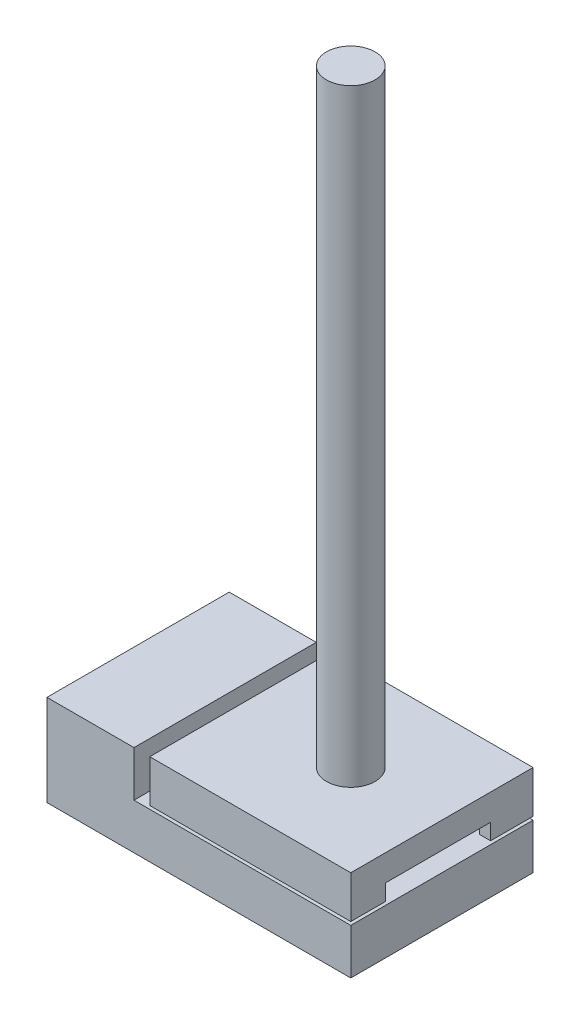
ISO-10303-21;
HEADER;
FILE_DESCRIPTION(('STEP AP214'),'2;1');
FILE_NAME('part.step','',(''),(''),'','','');
FILE_SCHEMA(('AUTOMOTIVE_DESIGN { 1 0 10303 214 1 1 1 1 }'));
ENDSEC;
DATA;
#1=APPLICATION_CONTEXT('core data for automotive mechanical design processes');
#2=APPLICATION_PROTOCOL_DEFINITION('international standard','automotive_design',2000,#1);
#3=PRODUCT_CONTEXT('',#1,'mechanical');
#4=PRODUCT('Part','Part','',(#3));
#5=PRODUCT_RELATED_PRODUCT_CATEGORY('part','',(#4));
#6=PRODUCT_DEFINITION_FORMATION('','',#4);
#7=PRODUCT_DEFINITION_CONTEXT('part definition',#1,'design');
#8=PRODUCT_DEFINITION('design','',#6,#7);
#9=PRODUCT_DEFINITION_SHAPE('','',#8);
#10=(LENGTH_UNIT() NAMED_UNIT(*) SI_UNIT(.MILLI.,.METRE.));
#11=(NAMED_UNIT(*) PLANE_ANGLE_UNIT() SI_UNIT($,.RADIAN.));
#12=(NAMED_UNIT(*) SI_UNIT($,.STERADIAN.) SOLID_ANGLE_UNIT());
#13=UNCERTAINTY_MEASURE_WITH_UNIT(LENGTH_MEASURE(1.E-05),#10,'distance_accuracy_value','');
#14=(GEOMETRIC_REPRESENTATION_CONTEXT(3) GLOBAL_UNCERTAINTY_ASSIGNED_CONTEXT((#13)) GLOBAL_UNIT_ASSIGNED_CONTEXT((#10,
#11,#12)) REPRESENTATION_CONTEXT('',''));
#15=CARTESIAN_POINT('',(0.,0.,0.));
#16=DIRECTION('',(0.,0.,1.));
#17=DIRECTION('',(1.,0.,0.));
#18=AXIS2_PLACEMENT_3D('',#15,#16,#17);
#19=CARTESIAN_POINT('',(40.,16.0856350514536,-16.0292412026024));
#20=DIRECTION('',(0.,0.,-1.));
#21=DIRECTION('',(-1.,0.,0.));
#22=AXIS2_PLACEMENT_3D('',#19,#20,#21);
#23=PLANE('',#22);
#24=DIRECTION('',(1.,0.,0.));
#25=VECTOR('',#24,1.);
#26=CARTESIAN_POINT('',(40.,16.0856350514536,-16.0292412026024));
#27=LINE('',#26,#25);
#28=CARTESIAN_POINT('',(40.,16.0856350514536,-16.0292412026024));
#29=VERTEX_POINT('',#28);
#30=CARTESIAN_POINT('',(43.8064635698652,16.0856350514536,-16.0292412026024));
#31=VERTEX_POINT('',#30);
#32=EDGE_CURVE('E225',#29,#31,#27,.T.);
#33=ORIENTED_EDGE('',*,*,#32,.T.);
#34=DIRECTION('',(0.,-1.,0.));
#35=VECTOR('',#34,1.);
#36=CARTESIAN_POINT('',(43.8064635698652,16.0856350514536,-16.0292412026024));
#37=LINE('',#36,#35);
#38=CARTESIAN_POINT('',(43.8064635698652,21.3846040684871,-16.0292412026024));
#39=VERTEX_POINT('',#38);
#40=EDGE_CURVE('E172',#39,#31,#37,.T.);
#41=ORIENTED_EDGE('',*,*,#40,.F.);
#42=DIRECTION('',(1.,0.,0.));
#43=VECTOR('',#42,1.);
#44=CARTESIAN_POINT('',(40.,21.3846040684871,-16.0292412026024));
#45=LINE('',#44,#43);
#46=CARTESIAN_POINT('',(40.,21.3846040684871,-16.0292412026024));
#47=VERTEX_POINT('',#46);
#48=EDGE_CURVE('E221',#47,#39,#45,.T.);
#49=ORIENTED_EDGE('',*,*,#48,.F.);
#50=DIRECTION('',(0.,1.,0.));
#51=VECTOR('',#50,1.);
#52=CARTESIAN_POINT('',(40.,16.0856350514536,-16.0292412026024));
#53=LINE('',#52,#51);
#54=EDGE_CURVE('E206',#29,#47,#53,.T.);
#55=ORIENTED_EDGE('',*,*,#54,.F.);
#56=EDGE_LOOP('',(#33,#41,#49,#55));
#57=FACE_BOUND('',#56,.T.);
#58=ADVANCED_FACE('F73',(#57),#23,.F.);
#59=CARTESIAN_POINT('',(50.,30.,-30.));
#60=DIRECTION('',(-1.,0.,0.));
#61=DIRECTION('',(0.,0.,1.));
#62=AXIS2_PLACEMENT_3D('',#59,#60,#61);
#63=PLANE('',#62);
#64=DIRECTION('',(0.,0.,1.));
#65=VECTOR('',#64,1.);
#66=CARTESIAN_POINT('',(50.,16.0856350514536,-170.));
#67=LINE('',#66,#65);
#68=CARTESIAN_POINT('',(50.,16.0856350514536,18.5404920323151));
#69=VERTEX_POINT('',#68);
#70=CARTESIAN_POINT('',(50.,16.0856350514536,30.));
#71=VERTEX_POINT('',#70);
#72=EDGE_CURVE('E245',#69,#71,#67,.T.);
#73=ORIENTED_EDGE('',*,*,#72,.F.);
#74=DIRECTION('',(0.,-1.,0.));
#75=VECTOR('',#74,1.);
#76=CARTESIAN_POINT('',(50.,16.0856350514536,18.5404920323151));
#77=LINE('',#76,#75);
#78=CARTESIAN_POINT('',(50.,21.3846040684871,18.5404920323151));
#79=VERTEX_POINT('',#78);
#80=EDGE_CURVE('E198',#79,#69,#77,.T.);
#81=ORIENTED_EDGE('',*,*,#80,.F.);
#82=DIRECTION('',(0.,0.,1.));
#83=VECTOR('',#82,1.);
#84=CARTESIAN_POINT('',(50.,21.3846040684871,18.5404920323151));
#85=LINE('',#84,#83);
#86=CARTESIAN_POINT('',(50.,21.3846040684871,-16.0292412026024));
#87=VERTEX_POINT('',#86);
#88=EDGE_CURVE('E204',#87,#79,#85,.T.);
#89=ORIENTED_EDGE('',*,*,#88,.F.);
#90=DIRECTION('',(0.,1.,0.));
#91=VECTOR('',#90,1.);
#92=CARTESIAN_POINT('',(50.,16.0856350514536,-16.0292412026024));
#93=LINE('',#92,#91);
#94=CARTESIAN_POINT('',(50.,16.0856350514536,-16.0292412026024));
#95=VERTEX_POINT('',#94);
#96=EDGE_CURVE('E213',#95,#87,#93,.T.);
#97=ORIENTED_EDGE('',*,*,#96,.F.);
#98=CARTESIAN_POINT('',(50.,16.0856350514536,-30.));
#99=VERTEX_POINT('',#98);
#100=EDGE_CURVE('E247',#99,#95,#67,.T.);
#101=ORIENTED_EDGE('',*,*,#100,.F.);
#102=DIRECTION('',(0.,-1.,0.));
#103=VECTOR('',#102,1.);
#104=CARTESIAN_POINT('',(50.,30.,-30.));
#105=LINE('',#104,#103);
#106=CARTESIAN_POINT('',(50.,30.,-30.));
#107=VERTEX_POINT('',#106);
#108=EDGE_CURVE('E256',#107,#99,#105,.T.);
#109=ORIENTED_EDGE('',*,*,#108,.F.);
#110=DIRECTION('',(0.,0.,-1.));
#111=VECTOR('',#110,1.);
#112=CARTESIAN_POINT('',(50.,30.,-30.));
#113=LINE('',#112,#111);
#114=CARTESIAN_POINT('',(50.,30.,30.));
#115=VERTEX_POINT('',#114);
#116=EDGE_CURVE('E234',#115,#107,#113,.T.);
#117=ORIENTED_EDGE('',*,*,#116,.F.);
#118=DIRECTION('',(0.,-1.,0.));
#119=VECTOR('',#118,1.);
#120=CARTESIAN_POINT('',(50.,30.,30.));
#121=LINE('',#120,#119);
#122=EDGE_CURVE('E220',#115,#71,#121,.T.);
#123=ORIENTED_EDGE('',*,*,#122,.T.);
#124=EDGE_LOOP('',(#73,#81,#89,#97,#101,#109,#117,#123));
#125=FACE_BOUND('',#124,.T.);
#126=ADVANCED_FACE('F75',(#125),#63,.F.);
#127=CARTESIAN_POINT('',(-50.,30.,-30.));
#128=DIRECTION('',(0.,0.,1.));
#129=DIRECTION('',(1.,0.,0.));
#130=AXIS2_PLACEMENT_3D('',#127,#128,#129);
#131=PLANE('',#130);
#132=DIRECTION('',(0.,-1.,0.));
#133=VECTOR('',#132,1.);
#134=CARTESIAN_POINT('',(-16.1595870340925,30.,-30.));
#135=LINE('',#134,#133);
#136=CARTESIAN_POINT('',(-16.1595870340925,30.,-30.));
#137=VERTEX_POINT('',#136);
#138=CARTESIAN_POINT('',(-16.1595870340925,16.0856350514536,-30.));
#139=VERTEX_POINT('',#138);
#140=EDGE_CURVE('E82',#137,#139,#135,.T.);
#141=ORIENTED_EDGE('',*,*,#140,.F.);
#142=DIRECTION('',(-1.,0.,0.));
#143=VECTOR('',#142,1.);
#144=CARTESIAN_POINT('',(-50.,30.,-30.));
#145=LINE('',#144,#143);
#146=EDGE_CURVE('E77',#107,#137,#145,.T.);
#147=ORIENTED_EDGE('',*,*,#146,.F.);
#148=ORIENTED_EDGE('',*,*,#108,.T.);
#149=DIRECTION('',(1.,0.,0.));
#150=VECTOR('',#149,1.);
#151=CARTESIAN_POINT('',(-50.,16.0856350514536,-30.));
#152=LINE('',#151,#150);
#153=EDGE_CURVE('E243',#139,#99,#152,.T.);
#154=ORIENTED_EDGE('',*,*,#153,.F.);
#155=EDGE_LOOP('',(#141,#147,#148,#154));
#156=FACE_BOUND('',#155,.T.);
#157=ADVANCED_FACE('F277',(#156),#131,.F.);
#158=CARTESIAN_POINT('',(-50.,30.,30.));
#159=DIRECTION('',(0.,0.,-1.));
#160=DIRECTION('',(-1.,0.,0.));
#161=AXIS2_PLACEMENT_3D('',#158,#159,#160);
#162=PLANE('',#161);
#163=DIRECTION('',(0.,-1.,0.));
#164=VECTOR('',#163,1.);
#165=CARTESIAN_POINT('',(-16.1595870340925,0.,30.));
#166=LINE('',#165,#164);
#167=CARTESIAN_POINT('',(-16.1595870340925,30.,30.));
#168=VERTEX_POINT('',#167);
#169=CARTESIAN_POINT('',(-16.1595870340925,16.0856350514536,30.));
#170=VERTEX_POINT('',#169);
#171=EDGE_CURVE('E253',#168,#170,#166,.T.);
#172=ORIENTED_EDGE('',*,*,#171,.T.);
#173=DIRECTION('',(1.,0.,0.));
#174=VECTOR('',#173,1.);
#175=CARTESIAN_POINT('',(-16.1595870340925,16.0856350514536,30.));
#176=LINE('',#175,#174);
#177=EDGE_CURVE('E250',#170,#71,#176,.T.);
#178=ORIENTED_EDGE('',*,*,#177,.T.);
#179=ORIENTED_EDGE('',*,*,#122,.F.);
#180=DIRECTION('',(1.,0.,0.));
#181=VECTOR('',#180,1.);
#182=CARTESIAN_POINT('',(-50.,30.,30.));
#183=LINE('',#182,#181);
#184=EDGE_CURVE('E233',#168,#115,#183,.T.);
#185=ORIENTED_EDGE('',*,*,#184,.F.);
#186=EDGE_LOOP('',(#172,#178,#179,#185));
#187=FACE_BOUND('',#186,.T.);
#188=ADVANCED_FACE('F268',(#187),#162,.F.);
#189=CARTESIAN_POINT('',(0.,30.,0.));
#190=DIRECTION('',(0.,1.,0.));
#191=DIRECTION('',(0.,0.,1.));
#192=AXIS2_PLACEMENT_3D('',#189,#190,#191);
#193=PLANE('',#192);
#194=CARTESIAN_POINT('',(20.,30.,0.));
#195=DIRECTION('',(0.,1.,0.));
#196=DIRECTION('',(0.,0.,1.));
#197=AXIS2_PLACEMENT_3D('',#194,#195,#196);
#198=CIRCLE('',#197,8.);
#199=CARTESIAN_POINT('',(20.,30.,8.));
#200=VERTEX_POINT('',#199);
#201=EDGE_CURVE('E237',#200,#200,#198,.T.);
#202=ORIENTED_EDGE('',*,*,#201,.F.);
#203=EDGE_LOOP('',(#202));
#204=FACE_BOUND('',#203,.T.);
#205=ORIENTED_EDGE('',*,*,#146,.T.);
#206=DIRECTION('',(0.,0.,1.));
#207=VECTOR('',#206,1.);
#208=CARTESIAN_POINT('',(-16.1595870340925,30.,0.));
#209=LINE('',#208,#207);
#210=EDGE_CURVE('E230',#137,#168,#209,.T.);
#211=ORIENTED_EDGE('',*,*,#210,.T.);
#212=ORIENTED_EDGE('',*,*,#184,.T.);
#213=ORIENTED_EDGE('',*,*,#116,.T.);
#214=EDGE_LOOP('',(#205,#211,#212,#213));
#215=FACE_BOUND('',#214,.T.);
#216=ADVANCED_FACE('F264',(#204,#215),#193,.T.);
#217=CARTESIAN_POINT('',(20.,230.,0.));
#218=DIRECTION('',(0.,-1.,0.));
#219=DIRECTION('',(0.,0.,-1.));
#220=AXIS2_PLACEMENT_3D('',#217,#218,#219);
#221=CYLINDRICAL_SURFACE('',#220,8.);
#222=CARTESIAN_POINT('',(20.,230.,0.));
#223=DIRECTION('',(0.,1.,0.));
#224=DIRECTION('',(0.,0.,1.));
#225=AXIS2_PLACEMENT_3D('',#222,#223,#224);
#226=CIRCLE('',#225,8.);
#227=CARTESIAN_POINT('',(20.,230.,8.));
#228=VERTEX_POINT('',#227);
#229=EDGE_CURVE('E240',#228,#228,#226,.T.);
#230=ORIENTED_EDGE('',*,*,#229,.F.);
#231=EDGE_LOOP('',(#230));
#232=FACE_BOUND('',#231,.T.);
#233=ORIENTED_EDGE('',*,*,#201,.T.);
#234=EDGE_LOOP('',(#233));
#235=FACE_BOUND('',#234,.T.);
#236=ADVANCED_FACE('F311',(#232,#235),#221,.T.);
#237=CARTESIAN_POINT('',(20.,230.,0.));
#238=DIRECTION('',(0.,1.,0.));
#239=DIRECTION('',(0.,0.,1.));
#240=AXIS2_PLACEMENT_3D('',#237,#238,#239);
#241=PLANE('',#240);
#242=ORIENTED_EDGE('',*,*,#229,.T.);
#243=EDGE_LOOP('',(#242));
#244=FACE_BOUND('',#243,.T.);
#245=ADVANCED_FACE('F314',(#244),#241,.T.);
#246=CARTESIAN_POINT('',(-16.1595870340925,16.0856350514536,-170.));
#247=DIRECTION('',(0.,-1.,0.));
#248=DIRECTION('',(0.,0.,-1.));
#249=AXIS2_PLACEMENT_3D('',#246,#247,#248);
#250=PLANE('',#249);
#251=DIRECTION('',(0.,0.,1.));
#252=VECTOR('',#251,1.);
#253=CARTESIAN_POINT('',(43.8064635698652,16.0856350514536,-20.0292412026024));
#254=LINE('',#253,#252);
#255=CARTESIAN_POINT('',(43.8064635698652,16.0856350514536,-20.0292412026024));
#256=VERTEX_POINT('',#255);
#257=EDGE_CURVE('E166',#256,#31,#254,.T.);
#258=ORIENTED_EDGE('',*,*,#257,.T.);
#259=ORIENTED_EDGE('',*,*,#32,.F.);
#260=DIRECTION('',(0.,0.,-1.));
#261=VECTOR('',#260,1.);
#262=CARTESIAN_POINT('',(40.,16.0856350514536,18.5404920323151));
#263=LINE('',#262,#261);
#264=CARTESIAN_POINT('',(40.,16.0856350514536,18.5404920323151));
#265=VERTEX_POINT('',#264);
#266=EDGE_CURVE('E203',#265,#29,#263,.T.);
#267=ORIENTED_EDGE('',*,*,#266,.F.);
#268=DIRECTION('',(1.,0.,0.));
#269=VECTOR('',#268,1.);
#270=CARTESIAN_POINT('',(40.,16.0856350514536,18.5404920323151));
#271=LINE('',#270,#269);
#272=EDGE_CURVE('E211',#265,#69,#271,.T.);
#273=ORIENTED_EDGE('',*,*,#272,.T.);
#274=ORIENTED_EDGE('',*,*,#72,.T.);
#275=ORIENTED_EDGE('',*,*,#177,.F.);
#276=DIRECTION('',(0.,0.,1.));
#277=VECTOR('',#276,1.);
#278=CARTESIAN_POINT('',(-16.1595870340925,16.0856350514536,-170.));
#279=LINE('',#278,#277);
#280=EDGE_CURVE('E13',#139,#170,#279,.T.);
#281=ORIENTED_EDGE('',*,*,#280,.F.);
#282=ORIENTED_EDGE('',*,*,#153,.T.);
#283=ORIENTED_EDGE('',*,*,#100,.T.);
#284=CARTESIAN_POINT('',(46.3487800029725,16.0856350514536,-16.0292412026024));
#285=VERTEX_POINT('',#284);
#286=EDGE_CURVE('E227',#285,#95,#27,.T.);
#287=ORIENTED_EDGE('',*,*,#286,.F.);
#288=DIRECTION('',(0.,0.,1.));
#289=VECTOR('',#288,1.);
#290=CARTESIAN_POINT('',(46.3487800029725,16.0856350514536,-20.0292412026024));
#291=LINE('',#290,#289);
#292=CARTESIAN_POINT('',(46.3487800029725,16.0856350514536,-20.0292412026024));
#293=VERTEX_POINT('',#292);
#294=EDGE_CURVE('E90',#293,#285,#291,.T.);
#295=ORIENTED_EDGE('',*,*,#294,.F.);
#296=DIRECTION('',(1.,0.,0.));
#297=VECTOR('',#296,1.);
#298=CARTESIAN_POINT('',(43.8064635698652,16.0856350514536,-20.0292412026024));
#299=LINE('',#298,#297);
#300=EDGE_CURVE('E183',#256,#293,#299,.T.);
#301=ORIENTED_EDGE('',*,*,#300,.F.);
#302=EDGE_LOOP('',(#258,#259,#267,#273,#274,#275,#281,#282,#283,#287,#295,#301));
#303=FACE_BOUND('',#302,.T.);
#304=ADVANCED_FACE('F187',(#303),#250,.T.);
#305=CARTESIAN_POINT('',(-16.1595870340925,0.,-170.));
#306=DIRECTION('',(-1.,0.,0.));
#307=DIRECTION('',(0.,0.,1.));
#308=AXIS2_PLACEMENT_3D('',#305,#306,#307);
#309=PLANE('',#308);
#310=ORIENTED_EDGE('',*,*,#140,.T.);
#311=ORIENTED_EDGE('',*,*,#280,.T.);
#312=ORIENTED_EDGE('',*,*,#171,.F.);
#313=ORIENTED_EDGE('',*,*,#210,.F.);
#314=EDGE_LOOP('',(#310,#311,#312,#313));
#315=FACE_BOUND('',#314,.T.);
#316=ADVANCED_FACE('F280',(#315),#309,.T.);
#317=CARTESIAN_POINT('',(40.,16.0856350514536,18.5404920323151));
#318=DIRECTION('',(0.,0.,1.));
#319=DIRECTION('',(1.,0.,0.));
#320=AXIS2_PLACEMENT_3D('',#317,#318,#319);
#321=PLANE('',#320);
#322=ORIENTED_EDGE('',*,*,#80,.T.);
#323=ORIENTED_EDGE('',*,*,#272,.F.);
#324=DIRECTION('',(0.,-1.,0.));
#325=VECTOR('',#324,1.);
#326=CARTESIAN_POINT('',(40.,16.0856350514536,18.5404920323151));
#327=LINE('',#326,#325);
#328=CARTESIAN_POINT('',(40.,21.3846040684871,18.5404920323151));
#329=VERTEX_POINT('',#328);
#330=EDGE_CURVE('E98',#329,#265,#327,.T.);
#331=ORIENTED_EDGE('',*,*,#330,.F.);
#332=DIRECTION('',(1.,0.,0.));
#333=VECTOR('',#332,1.);
#334=CARTESIAN_POINT('',(40.,21.3846040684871,18.5404920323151));
#335=LINE('',#334,#333);
#336=EDGE_CURVE('E218',#329,#79,#335,.T.);
#337=ORIENTED_EDGE('',*,*,#336,.T.);
#338=EDGE_LOOP('',(#322,#323,#331,#337));
#339=FACE_BOUND('',#338,.T.);
#340=ADVANCED_FACE('F285',(#339),#321,.F.);
#341=CARTESIAN_POINT('',(40.,21.3846040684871,18.5404920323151));
#342=DIRECTION('',(0.,1.,0.));
#343=DIRECTION('',(0.,0.,1.));
#344=AXIS2_PLACEMENT_3D('',#341,#342,#343);
#345=PLANE('',#344);
#346=ORIENTED_EDGE('',*,*,#88,.T.);
#347=ORIENTED_EDGE('',*,*,#336,.F.);
#348=DIRECTION('',(0.,0.,1.));
#349=VECTOR('',#348,1.);
#350=CARTESIAN_POINT('',(40.,21.3846040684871,18.5404920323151));
#351=LINE('',#350,#349);
#352=EDGE_CURVE('E209',#47,#329,#351,.T.);
#353=ORIENTED_EDGE('',*,*,#352,.F.);
#354=ORIENTED_EDGE('',*,*,#48,.T.);
#355=DIRECTION('',(0.,0.,1.));
#356=VECTOR('',#355,1.);
#357=CARTESIAN_POINT('',(43.8064635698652,21.3846040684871,-20.0292412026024));
#358=LINE('',#357,#356);
#359=CARTESIAN_POINT('',(43.8064635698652,21.3846040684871,-20.0292412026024));
#360=VERTEX_POINT('',#359);
#361=EDGE_CURVE('E196',#360,#39,#358,.T.);
#362=ORIENTED_EDGE('',*,*,#361,.F.);
#363=DIRECTION('',(-1.,0.,0.));
#364=VECTOR('',#363,1.);
#365=CARTESIAN_POINT('',(43.8064635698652,21.3846040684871,-20.0292412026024));
#366=LINE('',#365,#364);
#367=CARTESIAN_POINT('',(46.3487800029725,21.3846040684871,-20.0292412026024));
#368=VERTEX_POINT('',#367);
#369=EDGE_CURVE('E177',#368,#360,#366,.T.);
#370=ORIENTED_EDGE('',*,*,#369,.F.);
#371=DIRECTION('',(0.,0.,1.));
#372=VECTOR('',#371,1.);
#373=CARTESIAN_POINT('',(46.3487800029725,21.3846040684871,-20.0292412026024));
#374=LINE('',#373,#372);
#375=CARTESIAN_POINT('',(46.3487800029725,21.3846040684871,-16.0292412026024));
#376=VERTEX_POINT('',#375);
#377=EDGE_CURVE('E199',#368,#376,#374,.T.);
#378=ORIENTED_EDGE('',*,*,#377,.T.);
#379=EDGE_CURVE('E224',#376,#87,#45,.T.);
#380=ORIENTED_EDGE('',*,*,#379,.T.);
#381=EDGE_LOOP('',(#346,#347,#353,#354,#362,#370,#378,#380));
#382=FACE_BOUND('',#381,.T.);
#383=ADVANCED_FACE('F288',(#382),#345,.F.);
#384=ORIENTED_EDGE('',*,*,#379,.F.);
#385=DIRECTION('',(0.,1.,0.));
#386=VECTOR('',#385,1.);
#387=CARTESIAN_POINT('',(46.3487800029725,16.0856350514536,-16.0292412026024));
#388=LINE('',#387,#386);
#389=EDGE_CURVE('E185',#285,#376,#388,.T.);
#390=ORIENTED_EDGE('',*,*,#389,.F.);
#391=ORIENTED_EDGE('',*,*,#286,.T.);
#392=ORIENTED_EDGE('',*,*,#96,.T.);
#393=EDGE_LOOP('',(#384,#390,#391,#392));
#394=FACE_BOUND('',#393,.T.);
#395=ADVANCED_FACE('F291',(#394),#23,.F.);
#396=CARTESIAN_POINT('',(40.,0.,0.));
#397=DIRECTION('',(-1.,0.,0.));
#398=DIRECTION('',(0.,0.,1.));
#399=AXIS2_PLACEMENT_3D('',#396,#397,#398);
#400=PLANE('',#399);
#401=ORIENTED_EDGE('',*,*,#330,.T.);
#402=ORIENTED_EDGE('',*,*,#266,.T.);
#403=ORIENTED_EDGE('',*,*,#54,.T.);
#404=ORIENTED_EDGE('',*,*,#352,.T.);
#405=EDGE_LOOP('',(#401,#402,#403,#404));
#406=FACE_BOUND('',#405,.T.);
#407=ADVANCED_FACE('F294',(#406),#400,.F.);
#408=CARTESIAN_POINT('',(43.8064635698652,16.0856350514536,-20.0292412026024));
#409=DIRECTION('',(-1.,0.,0.));
#410=DIRECTION('',(0.,0.,1.));
#411=AXIS2_PLACEMENT_3D('',#408,#409,#410);
#412=PLANE('',#411);
#413=ORIENTED_EDGE('',*,*,#40,.T.);
#414=ORIENTED_EDGE('',*,*,#257,.F.);
#415=DIRECTION('',(0.,-1.,0.));
#416=VECTOR('',#415,1.);
#417=CARTESIAN_POINT('',(43.8064635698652,16.0856350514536,-20.0292412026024));
#418=LINE('',#417,#416);
#419=EDGE_CURVE('E169',#360,#256,#418,.T.);
#420=ORIENTED_EDGE('',*,*,#419,.F.);
#421=ORIENTED_EDGE('',*,*,#361,.T.);
#422=EDGE_LOOP('',(#413,#414,#420,#421));
#423=FACE_BOUND('',#422,.T.);
#424=ADVANCED_FACE('F168',(#423),#412,.F.);
#425=CARTESIAN_POINT('',(46.3487800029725,16.0856350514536,-20.0292412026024));
#426=DIRECTION('',(1.,0.,0.));
#427=DIRECTION('',(0.,0.,-1.));
#428=AXIS2_PLACEMENT_3D('',#425,#426,#427);
#429=PLANE('',#428);
#430=ORIENTED_EDGE('',*,*,#389,.T.);
#431=ORIENTED_EDGE('',*,*,#377,.F.);
#432=DIRECTION('',(0.,1.,0.));
#433=VECTOR('',#432,1.);
#434=CARTESIAN_POINT('',(46.3487800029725,16.0856350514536,-20.0292412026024));
#435=LINE('',#434,#433);
#436=EDGE_CURVE('E189',#293,#368,#435,.T.);
#437=ORIENTED_EDGE('',*,*,#436,.F.);
#438=ORIENTED_EDGE('',*,*,#294,.T.);
#439=EDGE_LOOP('',(#430,#431,#437,#438));
#440=FACE_BOUND('',#439,.T.);
#441=ADVANCED_FACE('F292',(#440),#429,.F.);
#442=CARTESIAN_POINT('',(0.,0.,-20.0292412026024));
#443=DIRECTION('',(0.,0.,-1.));
#444=DIRECTION('',(-1.,0.,0.));
#445=AXIS2_PLACEMENT_3D('',#442,#443,#444);
#446=PLANE('',#445);
#447=ORIENTED_EDGE('',*,*,#419,.T.);
#448=ORIENTED_EDGE('',*,*,#300,.T.);
#449=ORIENTED_EDGE('',*,*,#436,.T.);
#450=ORIENTED_EDGE('',*,*,#369,.T.);
#451=EDGE_LOOP('',(#447,#448,#449,#450));
#452=FACE_BOUND('',#451,.T.);
#453=ADVANCED_FACE('F181',(#452),#446,.F.);
#454=CLOSED_SHELL('',(#58,#126,#157,#188,#216,#236,#245,#304,#316,#340,#383,#395,#407,#424,#441,#453));
#455=MANIFOLD_SOLID_BREP('B2',#454);
#456=CARTESIAN_POINT('',(0.,0.,0.));
#457=DIRECTION('',(0.,1.,0.));
#458=DIRECTION('',(0.,0.,1.));
#459=AXIS2_PLACEMENT_3D('',#456,#457,#458);
#460=PLANE('',#459);
#461=DIRECTION('',(0.,0.,-1.));
#462=VECTOR('',#461,1.);
#463=CARTESIAN_POINT('',(50.,0.,-30.));
#464=LINE('',#463,#462);
#465=CARTESIAN_POINT('',(50.,0.,30.));
#466=VERTEX_POINT('',#465);
#467=CARTESIAN_POINT('',(50.,0.,-30.));
#468=VERTEX_POINT('',#467);
#469=EDGE_CURVE('E507',#466,#468,#464,.T.);
#470=ORIENTED_EDGE('',*,*,#469,.F.);
#471=DIRECTION('',(1.,0.,0.));
#472=VECTOR('',#471,1.);
#473=CARTESIAN_POINT('',(-50.,0.,30.));
#474=LINE('',#473,#472);
#475=CARTESIAN_POINT('',(-50.,0.,30.));
#476=VERTEX_POINT('',#475);
#477=EDGE_CURVE('E506',#476,#466,#474,.T.);
#478=ORIENTED_EDGE('',*,*,#477,.F.);
#479=CARTESIAN_POINT('',(24.0248996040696,0.,0.));
#480=DIRECTION('',(0.,-1.,0.));
#481=DIRECTION('',(0.,0.,1.));
#482=AXIS2_PLACEMENT_3D('',#479,#480,#481);
#483=CIRCLE('',#482,79.8729350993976);
#484=CARTESIAN_POINT('',(-50.,0.,-30.));
#485=VERTEX_POINT('',#484);
#486=EDGE_CURVE('E514',#476,#485,#483,.T.);
#487=ORIENTED_EDGE('',*,*,#486,.T.);
#488=DIRECTION('',(-1.,0.,0.));
#489=VECTOR('',#488,1.);
#490=CARTESIAN_POINT('',(-50.,0.,-30.));
#491=LINE('',#490,#489);
#492=EDGE_CURVE('E496',#468,#485,#491,.T.);
#493=ORIENTED_EDGE('',*,*,#492,.F.);
#494=EDGE_LOOP('',(#470,#478,#487,#493));
#495=FACE_BOUND('',#494,.T.);
#496=ADVANCED_FACE('F437',(#495),#460,.F.);
#497=CARTESIAN_POINT('',(-50.,30.,-30.));
#498=DIRECTION('',(1.,0.,0.));
#499=DIRECTION('',(0.,0.,-1.));
#500=AXIS2_PLACEMENT_3D('',#497,#498,#499);
#501=PLANE('',#500);
#502=DIRECTION('',(0.,-1.,0.));
#503=VECTOR('',#502,1.);
#504=CARTESIAN_POINT('',(-50.,30.,-30.));
#505=LINE('',#504,#503);
#506=CARTESIAN_POINT('',(-50.,30.,-30.));
#507=VERTEX_POINT('',#506);
#508=CARTESIAN_POINT('',(-50.,20.,-30.));
#509=VERTEX_POINT('',#508);
#510=EDGE_CURVE('E570',#507,#509,#505,.T.);
#511=ORIENTED_EDGE('',*,*,#510,.T.);
#512=DIRECTION('',(0.,0.,1.));
#513=VECTOR('',#512,1.);
#514=CARTESIAN_POINT('',(-50.,20.,-30.));
#515=LINE('',#514,#513);
#516=CARTESIAN_POINT('',(-50.,20.,30.));
#517=VERTEX_POINT('',#516);
#518=EDGE_CURVE('E453',#509,#517,#515,.T.);
#519=ORIENTED_EDGE('',*,*,#518,.T.);
#520=DIRECTION('',(0.,-1.,0.));
#521=VECTOR('',#520,1.);
#522=CARTESIAN_POINT('',(-50.,30.,30.));
#523=LINE('',#522,#521);
#524=CARTESIAN_POINT('',(-50.,30.,30.));
#525=VERTEX_POINT('',#524);
#526=EDGE_CURVE('E567',#525,#517,#523,.T.);
#527=ORIENTED_EDGE('',*,*,#526,.F.);
#528=DIRECTION('',(0.,0.,1.));
#529=VECTOR('',#528,1.);
#530=CARTESIAN_POINT('',(-50.,30.,-30.));
#531=LINE('',#530,#529);
#532=EDGE_CURVE('E553',#507,#525,#531,.T.);
#533=ORIENTED_EDGE('',*,*,#532,.F.);
#534=EDGE_LOOP('',(#511,#519,#527,#533));
#535=FACE_BOUND('',#534,.T.);
#536=ADVANCED_FACE('F575',(#535),#501,.F.);
#537=CARTESIAN_POINT('',(0.,30.,0.));
#538=DIRECTION('',(0.,1.,0.));
#539=DIRECTION('',(0.,0.,1.));
#540=AXIS2_PLACEMENT_3D('',#537,#538,#539);
#541=PLANE('',#540);
#542=DIRECTION('',(0.,0.,1.));
#543=VECTOR('',#542,1.);
#544=CARTESIAN_POINT('',(-21.3571289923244,30.,0.));
#545=LINE('',#544,#543);
#546=CARTESIAN_POINT('',(-21.3571289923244,30.,-30.));
#547=VERTEX_POINT('',#546);
#548=CARTESIAN_POINT('',(-21.3571289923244,30.,30.));
#549=VERTEX_POINT('',#548);
#550=EDGE_CURVE('E71',#547,#549,#545,.T.);
#551=ORIENTED_EDGE('',*,*,#550,.F.);
#552=DIRECTION('',(-1.,0.,0.));
#553=VECTOR('',#552,1.);
#554=CARTESIAN_POINT('',(-50.,30.,-30.));
#555=LINE('',#554,#553);
#556=EDGE_CURVE('E550',#547,#507,#555,.T.);
#557=ORIENTED_EDGE('',*,*,#556,.T.);
#558=ORIENTED_EDGE('',*,*,#532,.T.);
#559=DIRECTION('',(1.,0.,0.));
#560=VECTOR('',#559,1.);
#561=CARTESIAN_POINT('',(-50.,30.,30.));
#562=LINE('',#561,#560);
#563=EDGE_CURVE('E556',#525,#549,#562,.T.);
#564=ORIENTED_EDGE('',*,*,#563,.T.);
#565=EDGE_LOOP('',(#551,#557,#558,#564));
#566=FACE_BOUND('',#565,.T.);
#567=ADVANCED_FACE('F579',(#566),#541,.T.);
#568=CARTESIAN_POINT('',(-50.,30.,30.));
#569=DIRECTION('',(0.,0.,-1.));
#570=DIRECTION('',(-1.,0.,0.));
#571=AXIS2_PLACEMENT_3D('',#568,#569,#570);
#572=PLANE('',#571);
#573=DIRECTION('',(0.,-1.,0.));
#574=VECTOR('',#573,1.);
#575=CARTESIAN_POINT('',(50.,30.,30.));
#576=LINE('',#575,#574);
#577=CARTESIAN_POINT('',(50.,15.,30.));
#578=VERTEX_POINT('',#577);
#579=EDGE_CURVE('E560',#578,#466,#576,.T.);
#580=ORIENTED_EDGE('',*,*,#579,.F.);
#581=DIRECTION('',(1.,0.,0.));
#582=VECTOR('',#581,1.);
#583=CARTESIAN_POINT('',(0.,15.,30.));
#584=LINE('',#583,#582);
#585=CARTESIAN_POINT('',(-21.3571289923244,15.,30.));
#586=VERTEX_POINT('',#585);
#587=EDGE_CURVE('E535',#586,#578,#584,.T.);
#588=ORIENTED_EDGE('',*,*,#587,.F.);
#589=DIRECTION('',(0.,-1.,0.));
#590=VECTOR('',#589,1.);
#591=CARTESIAN_POINT('',(-21.3571289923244,0.,30.));
#592=LINE('',#591,#590);
#593=EDGE_CURVE('E531',#549,#586,#592,.T.);
#594=ORIENTED_EDGE('',*,*,#593,.F.);
#595=ORIENTED_EDGE('',*,*,#563,.F.);
#596=ORIENTED_EDGE('',*,*,#526,.T.);
#597=DIRECTION('',(0.,-1.,0.));
#598=VECTOR('',#597,1.);
#599=CARTESIAN_POINT('',(-50.,20.,30.));
#600=LINE('',#599,#598);
#601=EDGE_CURVE('E518',#517,#476,#600,.T.);
#602=ORIENTED_EDGE('',*,*,#601,.T.);
#603=ORIENTED_EDGE('',*,*,#477,.T.);
#604=EDGE_LOOP('',(#580,#588,#594,#595,#596,#602,#603));
#605=FACE_BOUND('',#604,.T.);
#606=ADVANCED_FACE('F588',(#605),#572,.F.);
#607=CARTESIAN_POINT('',(-50.,30.,-30.));
#608=DIRECTION('',(0.,0.,1.));
#609=DIRECTION('',(1.,0.,0.));
#610=AXIS2_PLACEMENT_3D('',#607,#608,#609);
#611=PLANE('',#610);
#612=DIRECTION('',(0.,-1.,0.));
#613=VECTOR('',#612,1.);
#614=CARTESIAN_POINT('',(-21.3571289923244,30.,-30.));
#615=LINE('',#614,#613);
#616=CARTESIAN_POINT('',(-21.3571289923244,15.,-30.));
#617=VERTEX_POINT('',#616);
#618=EDGE_CURVE('E541',#547,#617,#615,.T.);
#619=ORIENTED_EDGE('',*,*,#618,.T.);
#620=DIRECTION('',(1.,0.,0.));
#621=VECTOR('',#620,1.);
#622=CARTESIAN_POINT('',(-50.,15.,-30.));
#623=LINE('',#622,#621);
#624=CARTESIAN_POINT('',(50.,15.,-30.));
#625=VERTEX_POINT('',#624);
#626=EDGE_CURVE('E547',#617,#625,#623,.T.);
#627=ORIENTED_EDGE('',*,*,#626,.T.);
#628=DIRECTION('',(0.,-1.,0.));
#629=VECTOR('',#628,1.);
#630=CARTESIAN_POINT('',(50.,30.,-30.));
#631=LINE('',#630,#629);
#632=EDGE_CURVE('E446',#625,#468,#631,.T.);
#633=ORIENTED_EDGE('',*,*,#632,.T.);
#634=ORIENTED_EDGE('',*,*,#492,.T.);
#635=DIRECTION('',(0.,-1.,0.));
#636=VECTOR('',#635,1.);
#637=CARTESIAN_POINT('',(-50.,20.,-30.));
#638=LINE('',#637,#636);
#639=EDGE_CURVE('E461',#509,#485,#638,.T.);
#640=ORIENTED_EDGE('',*,*,#639,.F.);
#641=ORIENTED_EDGE('',*,*,#510,.F.);
#642=ORIENTED_EDGE('',*,*,#556,.F.);
#643=EDGE_LOOP('',(#619,#627,#633,#634,#640,#641,#642));
#644=FACE_BOUND('',#643,.T.);
#645=ADVANCED_FACE('F498',(#644),#611,.F.);
#646=CARTESIAN_POINT('',(50.,30.,-30.));
#647=DIRECTION('',(-1.,0.,0.));
#648=DIRECTION('',(0.,0.,1.));
#649=AXIS2_PLACEMENT_3D('',#646,#647,#648);
#650=PLANE('',#649);
#651=ORIENTED_EDGE('',*,*,#632,.F.);
#652=DIRECTION('',(0.,0.,1.));
#653=VECTOR('',#652,1.);
#654=CARTESIAN_POINT('',(50.,15.,-170.));
#655=LINE('',#654,#653);
#656=EDGE_CURVE('E529',#625,#578,#655,.T.);
#657=ORIENTED_EDGE('',*,*,#656,.T.);
#658=ORIENTED_EDGE('',*,*,#579,.T.);
#659=ORIENTED_EDGE('',*,*,#469,.T.);
#660=EDGE_LOOP('',(#651,#657,#658,#659));
#661=FACE_BOUND('',#660,.T.);
#662=ADVANCED_FACE('F439',(#661),#650,.F.);
#663=CARTESIAN_POINT('',(-21.3571289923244,0.,-170.));
#664=DIRECTION('',(-1.,0.,0.));
#665=DIRECTION('',(0.,0.,1.));
#666=AXIS2_PLACEMENT_3D('',#663,#664,#665);
#667=PLANE('',#666);
#668=ORIENTED_EDGE('',*,*,#550,.T.);
#669=ORIENTED_EDGE('',*,*,#593,.T.);
#670=DIRECTION('',(0.,0.,1.));
#671=VECTOR('',#670,1.);
#672=CARTESIAN_POINT('',(-21.3571289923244,15.,-170.));
#673=LINE('',#672,#671);
#674=EDGE_CURVE('E538',#617,#586,#673,.T.);
#675=ORIENTED_EDGE('',*,*,#674,.F.);
#676=ORIENTED_EDGE('',*,*,#618,.F.);
#677=EDGE_LOOP('',(#668,#669,#675,#676));
#678=FACE_BOUND('',#677,.T.);
#679=ADVANCED_FACE('F583',(#678),#667,.F.);
#680=CARTESIAN_POINT('',(0.,15.,-170.));
#681=DIRECTION('',(0.,-1.,0.));
#682=DIRECTION('',(0.,0.,-1.));
#683=AXIS2_PLACEMENT_3D('',#680,#681,#682);
#684=PLANE('',#683);
#685=ORIENTED_EDGE('',*,*,#674,.T.);
#686=ORIENTED_EDGE('',*,*,#587,.T.);
#687=ORIENTED_EDGE('',*,*,#656,.F.);
#688=ORIENTED_EDGE('',*,*,#626,.F.);
#689=EDGE_LOOP('',(#685,#686,#687,#688));
#690=FACE_BOUND('',#689,.T.);
#691=ADVANCED_FACE('F590',(#690),#684,.F.);
#692=CARTESIAN_POINT('',(24.0248996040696,20.,0.));
#693=DIRECTION('',(0.,-1.,0.));
#694=DIRECTION('',(0.,0.,-1.));
#695=AXIS2_PLACEMENT_3D('',#692,#693,#694);
#696=CYLINDRICAL_SURFACE('',#695,79.8729350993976);
#697=ORIENTED_EDGE('',*,*,#486,.F.);
#698=ORIENTED_EDGE('',*,*,#601,.F.);
#699=CARTESIAN_POINT('',(24.0248996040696,20.,0.));
#700=DIRECTION('',(0.,-1.,0.));
#701=DIRECTION('',(0.,0.,1.));
#702=AXIS2_PLACEMENT_3D('',#699,#700,#701);
#703=CIRCLE('',#702,79.8729350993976);
#704=EDGE_CURVE('E516',#517,#509,#703,.T.);
#705=ORIENTED_EDGE('',*,*,#704,.T.);
#706=ORIENTED_EDGE('',*,*,#639,.T.);
#707=EDGE_LOOP('',(#697,#698,#705,#706));
#708=FACE_BOUND('',#707,.T.);
#709=ADVANCED_FACE('F512',(#708),#696,.T.);
#710=CARTESIAN_POINT('',(24.0248996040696,20.,0.));
#711=DIRECTION('',(0.,1.,0.));
#712=DIRECTION('',(0.,0.,1.));
#713=AXIS2_PLACEMENT_3D('',#710,#711,#712);
#714=PLANE('',#713);
#715=ORIENTED_EDGE('',*,*,#704,.F.);
#716=ORIENTED_EDGE('',*,*,#518,.F.);
#717=EDGE_LOOP('',(#715,#716));
#718=FACE_BOUND('',#717,.T.);
#719=ADVANCED_FACE('F593',(#718),#714,.T.);
#720=CLOSED_SHELL('',(#496,#536,#567,#606,#645,#662,#679,#691,#709,#719));
#721=MANIFOLD_SOLID_BREP('B7',#720);
#722=ADVANCED_BREP_SHAPE_REPRESENTATION('',(#18,#455,#721),#14);
#723=SHAPE_DEFINITION_REPRESENTATION(#9,#722);
ENDSEC;
END-ISO-10303-21;
